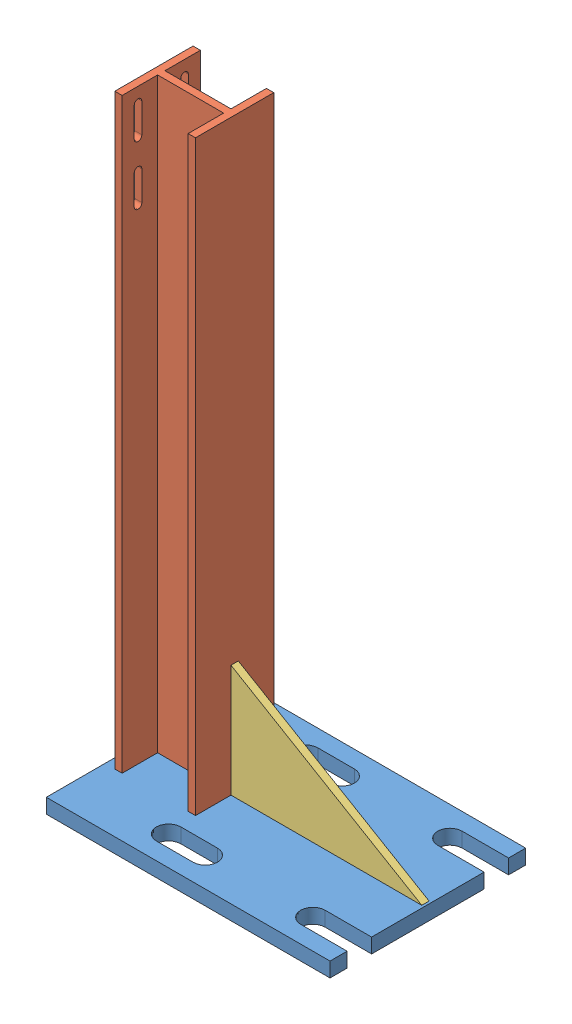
SolidWorks assembly Christmas Tree Stand.SLDASM, configuration Default (file format 13000). Lengths in mm.
Overall size (368.3 781.05 254).
3 component instances, 3 part files, 8 mates.
Components (placement in the parent):
- Slotted Base-1: Slotted Base.SLDPRT [Default] at (-51.1039 188.7078 407.9404) size (368.3 19.05 254)
- I-Beam Support-1: I-Beam Support.SLDPRT [Default] at (66.3711 207.7578 331.7404) x (0 0 -1) z (1 0 0) size (101.6 762 104.77)
- Gusset Plate-1: Gusset Plate.SLDPRT [Default] at (66.3711 207.7578 276.1779) size (247.65 146.05 9.53)
Mates (geometry in assembly coordinates):
- Coincident1: coincident anti-aligned: plane of Slotted Base-1 through (-51.1039 207.7578 407.9404) normal (0 1 0); plane of I-Beam Support-1 through (66.3711 207.7578 331.7404) normal (0 -1 0)
- Parallel1: parallel aligned: plane of Slotted Base-1 through (-51.1039 207.7578 407.9404) normal (-1 0 0); plane of I-Beam Support-1 through (-38.4039 969.7578 331.7404) normal (-1 0 0)
- Parallel2: parallel aligned: plane of Slotted Base-1 through (-51.1039 207.7578 407.9404) normal (-1 0 0); plane of I-Beam Support-1 through (-38.4039 969.7578 331.7404) normal (-1 0 0)
- Distance2: distance = 12.7 mm aligned: plane of I-Beam Support-1 through (-38.4039 969.7578 331.7404) normal (-1 0 0); plane of Slotted Base-1 through (-51.1039 207.7578 407.9404) normal (-1 0 0)
- Distance3: distance = 76.2 mm: plane of Slotted Base-1 through (-51.1039 207.7578 407.9404) normal (0 0 1); line of I-Beam Support-1 through (-38.4039 969.7578 331.7404) axis (0 -1 0)
- Coincident7: coincident anti-aligned: plane of I-Beam Support-1 through (66.3711 969.7578 331.7404) normal (1 0 0); plane of Gusset Plate-1 through (66.3711 207.7578 285.7029) normal (-1 0 0)
- Coincident8: coincident anti-aligned: plane of Slotted Base-1 through (-51.1039 207.7578 407.9404) normal (0 1 0); plane of Gusset Plate-1 through (314.0211 207.7578 285.7029) normal (0 -1 0)
- Distance4: distance = 46.0375 mm aligned: plane of I-Beam Support-1 through (66.3711 969.7578 331.7404) normal (0 0 1); plane of Gusset Plate-1 through (66.3711 207.7578 285.7029) normal (0 0 1)
